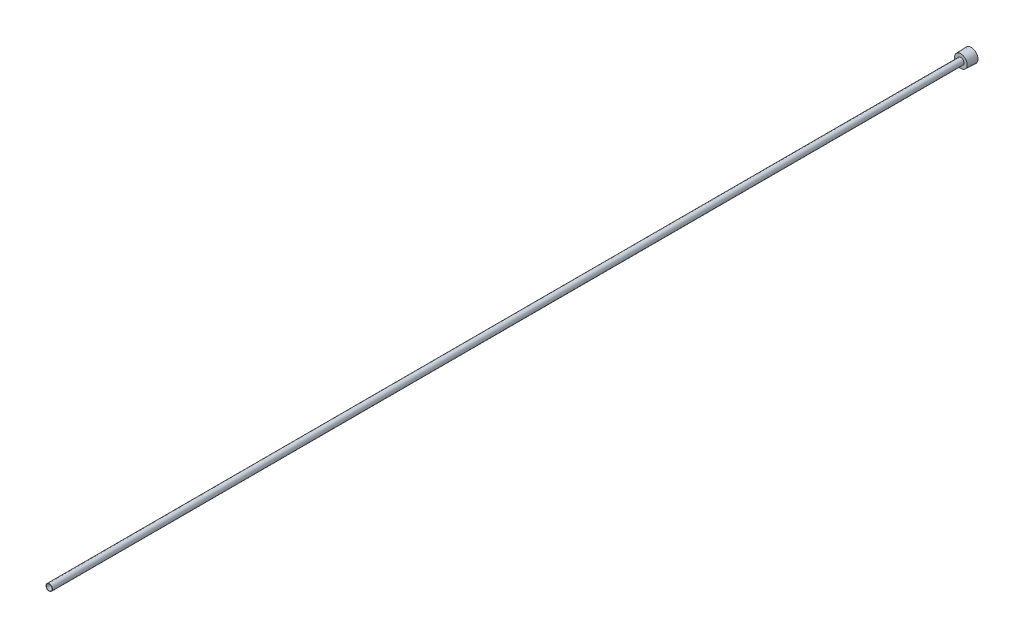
ISO-10303-21;
HEADER;
FILE_DESCRIPTION(('STEP AP214'),'2;1');
FILE_NAME('part.step','',(''),(''),'','','');
FILE_SCHEMA(('AUTOMOTIVE_DESIGN { 1 0 10303 214 1 1 1 1 }'));
ENDSEC;
DATA;
#1=APPLICATION_CONTEXT('core data for automotive mechanical design processes');
#2=APPLICATION_PROTOCOL_DEFINITION('international standard','automotive_design',2000,#1);
#3=PRODUCT_CONTEXT('',#1,'mechanical');
#4=PRODUCT('Part','Part','',(#3));
#5=PRODUCT_RELATED_PRODUCT_CATEGORY('part','',(#4));
#6=PRODUCT_DEFINITION_FORMATION('','',#4);
#7=PRODUCT_DEFINITION_CONTEXT('part definition',#1,'design');
#8=PRODUCT_DEFINITION('design','',#6,#7);
#9=PRODUCT_DEFINITION_SHAPE('','',#8);
#10=(LENGTH_UNIT() NAMED_UNIT(*) SI_UNIT(.MILLI.,.METRE.));
#11=(NAMED_UNIT(*) PLANE_ANGLE_UNIT() SI_UNIT($,.RADIAN.));
#12=(NAMED_UNIT(*) SI_UNIT($,.STERADIAN.) SOLID_ANGLE_UNIT());
#13=UNCERTAINTY_MEASURE_WITH_UNIT(LENGTH_MEASURE(1.E-05),#10,'distance_accuracy_value','');
#14=(GEOMETRIC_REPRESENTATION_CONTEXT(3) GLOBAL_UNCERTAINTY_ASSIGNED_CONTEXT((#13)) GLOBAL_UNIT_ASSIGNED_CONTEXT((#10,
#11,#12)) REPRESENTATION_CONTEXT('',''));
#15=CARTESIAN_POINT('',(0.,0.,0.));
#16=DIRECTION('',(0.,0.,1.));
#17=DIRECTION('',(1.,0.,0.));
#18=AXIS2_PLACEMENT_3D('',#15,#16,#17);
#19=CARTESIAN_POINT('',(0.,0.,0.));
#20=DIRECTION('',(0.,0.,1.));
#21=DIRECTION('',(1.,0.,0.));
#22=AXIS2_PLACEMENT_3D('',#19,#20,#21);
#23=CYLINDRICAL_SURFACE('',#22,2.921);
#24=CARTESIAN_POINT('',(0.,0.,914.4));
#25=DIRECTION('',(0.,0.,1.));
#26=DIRECTION('',(1.,0.,0.));
#27=AXIS2_PLACEMENT_3D('',#24,#25,#26);
#28=CIRCLE('',#27,2.921);
#29=CARTESIAN_POINT('',(2.921,0.,914.4));
#30=VERTEX_POINT('',#29);
#31=EDGE_CURVE('E142',#30,#30,#28,.T.);
#32=ORIENTED_EDGE('',*,*,#31,.T.);
#33=EDGE_LOOP('',(#32));
#34=FACE_BOUND('',#33,.T.);
#35=CARTESIAN_POINT('',(0.,0.,6.35));
#36=DIRECTION('',(0.,0.,-1.));
#37=DIRECTION('',(-1.,0.,0.));
#38=AXIS2_PLACEMENT_3D('',#35,#36,#37);
#39=CIRCLE('',#38,2.921);
#40=CARTESIAN_POINT('',(-2.921,0.,6.35));
#41=VERTEX_POINT('',#40);
#42=EDGE_CURVE('E37',#41,#41,#39,.F.);
#43=ORIENTED_EDGE('',*,*,#42,.F.);
#44=EDGE_LOOP('',(#43));
#45=FACE_BOUND('',#44,.T.);
#46=ADVANCED_FACE('F33',(#34,#45),#23,.F.);
#47=CARTESIAN_POINT('',(0.,0.,0.));
#48=DIRECTION('',(0.,0.,-1.));
#49=DIRECTION('',(-1.,0.,0.));
#50=AXIS2_PLACEMENT_3D('',#47,#48,#49);
#51=CONICAL_SURFACE('',#50,6.7183,0.0364599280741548);
#52=CARTESIAN_POINT('',(0.,0.,10.3124));
#53=DIRECTION('',(0.,0.,1.));
#54=DIRECTION('',(1.,0.,0.));
#55=AXIS2_PLACEMENT_3D('',#52,#53,#54);
#56=CIRCLE('',#55,6.34214394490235);
#57=CARTESIAN_POINT('',(6.34214394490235,0.,10.3124));
#58=VERTEX_POINT('',#57);
#59=EDGE_CURVE('E11',#58,#58,#56,.T.);
#60=ORIENTED_EDGE('',*,*,#59,.F.);
#61=EDGE_LOOP('',(#60));
#62=FACE_BOUND('',#61,.T.);
#63=CARTESIAN_POINT('',(0.,0.,0.));
#64=DIRECTION('',(0.,0.,1.));
#65=DIRECTION('',(1.,0.,0.));
#66=AXIS2_PLACEMENT_3D('',#63,#64,#65);
#67=CIRCLE('',#66,6.7183);
#68=CARTESIAN_POINT('',(6.7183,0.,0.));
#69=VERTEX_POINT('',#68);
#70=EDGE_CURVE('E145',#69,#69,#67,.T.);
#71=ORIENTED_EDGE('',*,*,#70,.T.);
#72=EDGE_LOOP('',(#71));
#73=FACE_BOUND('',#72,.T.);
#74=ADVANCED_FACE('F35',(#62,#73),#51,.T.);
#75=CARTESIAN_POINT('',(0.,6.34214394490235,10.3124));
#76=DIRECTION('',(0.,0.,-1.));
#77=DIRECTION('',(-1.,0.,0.));
#78=AXIS2_PLACEMENT_3D('',#75,#76,#77);
#79=PLANE('',#78);
#80=CARTESIAN_POINT('',(0.,0.,10.3124));
#81=DIRECTION('',(0.,0.,1.));
#82=DIRECTION('',(1.,0.,0.));
#83=AXIS2_PLACEMENT_3D('',#80,#81,#82);
#84=CIRCLE('',#83,3.175);
#85=CARTESIAN_POINT('',(3.175,0.,10.3124));
#86=VERTEX_POINT('',#85);
#87=EDGE_CURVE('E42',#86,#86,#84,.T.);
#88=ORIENTED_EDGE('',*,*,#87,.F.);
#89=EDGE_LOOP('',(#88));
#90=FACE_BOUND('',#89,.T.);
#91=ORIENTED_EDGE('',*,*,#59,.T.);
#92=EDGE_LOOP('',(#91));
#93=FACE_BOUND('',#92,.T.);
#94=ADVANCED_FACE('F156',(#90,#93),#79,.F.);
#95=CARTESIAN_POINT('',(0.,0.,331.124179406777));
#96=DIRECTION('',(0.,0.,1.));
#97=DIRECTION('',(1.,0.,0.));
#98=AXIS2_PLACEMENT_3D('',#95,#96,#97);
#99=CYLINDRICAL_SURFACE('',#98,3.17499999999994);
#100=CARTESIAN_POINT('',(0.,0.,914.4));
#101=DIRECTION('',(0.,0.,1.));
#102=DIRECTION('',(1.,0.,0.));
#103=AXIS2_PLACEMENT_3D('',#100,#101,#102);
#104=CIRCLE('',#103,3.17499999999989);
#105=CARTESIAN_POINT('',(3.17499999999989,0.,914.4));
#106=VERTEX_POINT('',#105);
#107=EDGE_CURVE('E148',#106,#106,#104,.T.);
#108=ORIENTED_EDGE('',*,*,#107,.F.);
#109=EDGE_LOOP('',(#108));
#110=FACE_BOUND('',#109,.T.);
#111=ORIENTED_EDGE('',*,*,#87,.T.);
#112=EDGE_LOOP('',(#111));
#113=FACE_BOUND('',#112,.T.);
#114=ADVANCED_FACE('F154',(#110,#113),#99,.T.);
#115=CARTESIAN_POINT('',(0.,3.17499999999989,914.4));
#116=DIRECTION('',(0.,0.,-1.));
#117=DIRECTION('',(-1.,0.,0.));
#118=AXIS2_PLACEMENT_3D('',#115,#116,#117);
#119=PLANE('',#118);
#120=ORIENTED_EDGE('',*,*,#31,.F.);
#121=EDGE_LOOP('',(#120));
#122=FACE_BOUND('',#121,.T.);
#123=ORIENTED_EDGE('',*,*,#107,.T.);
#124=EDGE_LOOP('',(#123));
#125=FACE_BOUND('',#124,.T.);
#126=ADVANCED_FACE('F167',(#122,#125),#119,.F.);
#127=CARTESIAN_POINT('',(0.,0.,0.));
#128=DIRECTION('',(0.,0.,1.));
#129=DIRECTION('',(1.,0.,0.));
#130=AXIS2_PLACEMENT_3D('',#127,#128,#129);
#131=PLANE('',#130);
#132=DIRECTION('',(-0.866025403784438,-0.5,0.));
#133=VECTOR('',#132,1.);
#134=CARTESIAN_POINT('',(3.175,-1.83308710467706,0.));
#135=LINE('',#134,#133);
#136=CARTESIAN_POINT('',(3.175,-1.83308710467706,0.));
#137=VERTEX_POINT('',#136);
#138=CARTESIAN_POINT('',(0.,-3.66617420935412,0.));
#139=VERTEX_POINT('',#138);
#140=EDGE_CURVE('E124',#137,#139,#135,.T.);
#141=ORIENTED_EDGE('',*,*,#140,.F.);
#142=DIRECTION('',(0.,-1.,0.));
#143=VECTOR('',#142,1.);
#144=CARTESIAN_POINT('',(3.175,1.83308710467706,0.));
#145=LINE('',#144,#143);
#146=CARTESIAN_POINT('',(3.175,1.83308710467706,0.));
#147=VERTEX_POINT('',#146);
#148=EDGE_CURVE('E49',#147,#137,#145,.T.);
#149=ORIENTED_EDGE('',*,*,#148,.F.);
#150=DIRECTION('',(0.866025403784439,-0.5,0.));
#151=VECTOR('',#150,1.);
#152=CARTESIAN_POINT('',(0.,3.66617420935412,0.));
#153=LINE('',#152,#151);
#154=CARTESIAN_POINT('',(0.,3.66617420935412,0.));
#155=VERTEX_POINT('',#154);
#156=EDGE_CURVE('E133',#155,#147,#153,.T.);
#157=ORIENTED_EDGE('',*,*,#156,.F.);
#158=DIRECTION('',(0.866025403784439,0.5,0.));
#159=VECTOR('',#158,1.);
#160=CARTESIAN_POINT('',(-3.175,1.83308710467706,0.));
#161=LINE('',#160,#159);
#162=CARTESIAN_POINT('',(-3.175,1.83308710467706,0.));
#163=VERTEX_POINT('',#162);
#164=EDGE_CURVE('E131',#163,#155,#161,.T.);
#165=ORIENTED_EDGE('',*,*,#164,.F.);
#166=DIRECTION('',(0.,1.,0.));
#167=VECTOR('',#166,1.);
#168=CARTESIAN_POINT('',(-3.175,-1.83308710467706,0.));
#169=LINE('',#168,#167);
#170=CARTESIAN_POINT('',(-3.175,-1.83308710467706,0.));
#171=VERTEX_POINT('',#170);
#172=EDGE_CURVE('E97',#171,#163,#169,.T.);
#173=ORIENTED_EDGE('',*,*,#172,.F.);
#174=DIRECTION('',(-0.866025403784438,0.5,0.));
#175=VECTOR('',#174,1.);
#176=CARTESIAN_POINT('',(0.,-3.66617420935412,0.));
#177=LINE('',#176,#175);
#178=EDGE_CURVE('E127',#139,#171,#177,.T.);
#179=ORIENTED_EDGE('',*,*,#178,.F.);
#180=EDGE_LOOP('',(#141,#149,#157,#165,#173,#179));
#181=FACE_BOUND('',#180,.T.);
#182=ORIENTED_EDGE('',*,*,#70,.F.);
#183=EDGE_LOOP('',(#182));
#184=FACE_BOUND('',#183,.T.);
#185=ADVANCED_FACE('F165',(#181,#184),#131,.F.);
#186=CARTESIAN_POINT('',(3.175,-1.83308710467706,6.35));
#187=DIRECTION('',(0.,0.,-1.));
#188=DIRECTION('',(-1.,0.,0.));
#189=AXIS2_PLACEMENT_3D('',#186,#187,#188);
#190=PLANE('',#189);
#191=DIRECTION('',(0.,-1.,0.));
#192=VECTOR('',#191,1.);
#193=CARTESIAN_POINT('',(3.175,1.83308710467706,6.35));
#194=LINE('',#193,#192);
#195=CARTESIAN_POINT('',(3.175,1.83308710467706,6.35));
#196=VERTEX_POINT('',#195);
#197=CARTESIAN_POINT('',(3.175,-1.83308710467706,6.35));
#198=VERTEX_POINT('',#197);
#199=EDGE_CURVE('E135',#196,#198,#194,.T.);
#200=ORIENTED_EDGE('',*,*,#199,.T.);
#201=DIRECTION('',(-0.866025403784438,-0.5,0.));
#202=VECTOR('',#201,1.);
#203=CARTESIAN_POINT('',(3.175,-1.83308710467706,6.35));
#204=LINE('',#203,#202);
#205=CARTESIAN_POINT('',(0.,-3.66617420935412,6.35));
#206=VERTEX_POINT('',#205);
#207=EDGE_CURVE('E118',#198,#206,#204,.T.);
#208=ORIENTED_EDGE('',*,*,#207,.T.);
#209=DIRECTION('',(-0.866025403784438,0.5,0.));
#210=VECTOR('',#209,1.);
#211=CARTESIAN_POINT('',(0.,-3.66617420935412,6.35));
#212=LINE('',#211,#210);
#213=CARTESIAN_POINT('',(-3.175,-1.83308710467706,6.35));
#214=VERTEX_POINT('',#213);
#215=EDGE_CURVE('E116',#206,#214,#212,.T.);
#216=ORIENTED_EDGE('',*,*,#215,.T.);
#217=DIRECTION('',(0.,1.,0.));
#218=VECTOR('',#217,1.);
#219=CARTESIAN_POINT('',(-3.175,-1.83308710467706,6.35));
#220=LINE('',#219,#218);
#221=CARTESIAN_POINT('',(-3.175,1.83308710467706,6.35));
#222=VERTEX_POINT('',#221);
#223=EDGE_CURVE('E94',#214,#222,#220,.T.);
#224=ORIENTED_EDGE('',*,*,#223,.T.);
#225=DIRECTION('',(0.866025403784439,0.5,0.));
#226=VECTOR('',#225,1.);
#227=CARTESIAN_POINT('',(-3.175,1.83308710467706,6.35));
#228=LINE('',#227,#226);
#229=CARTESIAN_POINT('',(0.,3.66617420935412,6.35));
#230=VERTEX_POINT('',#229);
#231=EDGE_CURVE('E105',#222,#230,#228,.T.);
#232=ORIENTED_EDGE('',*,*,#231,.T.);
#233=DIRECTION('',(0.866025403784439,-0.5,0.));
#234=VECTOR('',#233,1.);
#235=CARTESIAN_POINT('',(0.,3.66617420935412,6.35));
#236=LINE('',#235,#234);
#237=EDGE_CURVE('E109',#230,#196,#236,.T.);
#238=ORIENTED_EDGE('',*,*,#237,.T.);
#239=EDGE_LOOP('',(#200,#208,#216,#224,#232,#238));
#240=FACE_BOUND('',#239,.T.);
#241=ORIENTED_EDGE('',*,*,#42,.T.);
#242=EDGE_LOOP('',(#241));
#243=FACE_BOUND('',#242,.T.);
#244=ADVANCED_FACE('F112',(#240,#243),#190,.T.);
#245=CARTESIAN_POINT('',(3.175,1.83308710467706,6.35));
#246=DIRECTION('',(1.,0.,0.));
#247=DIRECTION('',(0.,1.,0.));
#248=AXIS2_PLACEMENT_3D('',#245,#246,#247);
#249=PLANE('',#248);
#250=ORIENTED_EDGE('',*,*,#148,.T.);
#251=DIRECTION('',(0.,0.,-1.));
#252=VECTOR('',#251,1.);
#253=CARTESIAN_POINT('',(3.175,-1.83308710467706,6.35));
#254=LINE('',#253,#252);
#255=EDGE_CURVE('E79',#198,#137,#254,.T.);
#256=ORIENTED_EDGE('',*,*,#255,.F.);
#257=ORIENTED_EDGE('',*,*,#199,.F.);
#258=DIRECTION('',(0.,0.,-1.));
#259=VECTOR('',#258,1.);
#260=CARTESIAN_POINT('',(3.175,1.83308710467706,6.35));
#261=LINE('',#260,#259);
#262=EDGE_CURVE('E57',#196,#147,#261,.T.);
#263=ORIENTED_EDGE('',*,*,#262,.T.);
#264=EDGE_LOOP('',(#250,#256,#257,#263));
#265=FACE_BOUND('',#264,.T.);
#266=ADVANCED_FACE('F174',(#265),#249,.F.);
#267=CARTESIAN_POINT('',(0.,3.66617420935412,6.35));
#268=DIRECTION('',(0.5,0.866025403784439,0.));
#269=DIRECTION('',(-0.866025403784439,0.5,0.));
#270=AXIS2_PLACEMENT_3D('',#267,#268,#269);
#271=PLANE('',#270);
#272=ORIENTED_EDGE('',*,*,#156,.T.);
#273=ORIENTED_EDGE('',*,*,#262,.F.);
#274=ORIENTED_EDGE('',*,*,#237,.F.);
#275=DIRECTION('',(0.,0.,-1.));
#276=VECTOR('',#275,1.);
#277=CARTESIAN_POINT('',(0.,3.66617420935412,6.35));
#278=LINE('',#277,#276);
#279=EDGE_CURVE('E101',#230,#155,#278,.T.);
#280=ORIENTED_EDGE('',*,*,#279,.T.);
#281=EDGE_LOOP('',(#272,#273,#274,#280));
#282=FACE_BOUND('',#281,.T.);
#283=ADVANCED_FACE('F188',(#282),#271,.F.);
#284=CARTESIAN_POINT('',(-3.175,1.83308710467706,6.35));
#285=DIRECTION('',(-0.5,0.866025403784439,0.));
#286=DIRECTION('',(-0.866025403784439,-0.5,0.));
#287=AXIS2_PLACEMENT_3D('',#284,#285,#286);
#288=PLANE('',#287);
#289=ORIENTED_EDGE('',*,*,#164,.T.);
#290=ORIENTED_EDGE('',*,*,#279,.F.);
#291=ORIENTED_EDGE('',*,*,#231,.F.);
#292=DIRECTION('',(0.,0.,-1.));
#293=VECTOR('',#292,1.);
#294=CARTESIAN_POINT('',(-3.175,1.83308710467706,6.35));
#295=LINE('',#294,#293);
#296=EDGE_CURVE('E90',#222,#163,#295,.T.);
#297=ORIENTED_EDGE('',*,*,#296,.T.);
#298=EDGE_LOOP('',(#289,#290,#291,#297));
#299=FACE_BOUND('',#298,.T.);
#300=ADVANCED_FACE('F106',(#299),#288,.F.);
#301=CARTESIAN_POINT('',(-3.175,-1.83308710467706,6.35));
#302=DIRECTION('',(-1.,0.,0.));
#303=DIRECTION('',(0.,-1.,0.));
#304=AXIS2_PLACEMENT_3D('',#301,#302,#303);
#305=PLANE('',#304);
#306=ORIENTED_EDGE('',*,*,#172,.T.);
#307=ORIENTED_EDGE('',*,*,#296,.F.);
#308=ORIENTED_EDGE('',*,*,#223,.F.);
#309=DIRECTION('',(0.,0.,-1.));
#310=VECTOR('',#309,1.);
#311=CARTESIAN_POINT('',(-3.175,-1.83308710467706,6.35));
#312=LINE('',#311,#310);
#313=EDGE_CURVE('E102',#214,#171,#312,.T.);
#314=ORIENTED_EDGE('',*,*,#313,.T.);
#315=EDGE_LOOP('',(#306,#307,#308,#314));
#316=FACE_BOUND('',#315,.T.);
#317=ADVANCED_FACE('F92',(#316),#305,.F.);
#318=CARTESIAN_POINT('',(0.,-3.66617420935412,6.35));
#319=DIRECTION('',(-0.5,-0.866025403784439,0.));
#320=DIRECTION('',(0.866025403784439,-0.5,0.));
#321=AXIS2_PLACEMENT_3D('',#318,#319,#320);
#322=PLANE('',#321);
#323=ORIENTED_EDGE('',*,*,#178,.T.);
#324=ORIENTED_EDGE('',*,*,#313,.F.);
#325=ORIENTED_EDGE('',*,*,#215,.F.);
#326=DIRECTION('',(0.,0.,-1.));
#327=VECTOR('',#326,1.);
#328=CARTESIAN_POINT('',(0.,-3.66617420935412,6.35));
#329=LINE('',#328,#327);
#330=EDGE_CURVE('E139',#206,#139,#329,.T.);
#331=ORIENTED_EDGE('',*,*,#330,.T.);
#332=EDGE_LOOP('',(#323,#324,#325,#331));
#333=FACE_BOUND('',#332,.T.);
#334=ADVANCED_FACE('F192',(#333),#322,.F.);
#335=CARTESIAN_POINT('',(3.175,-1.83308710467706,6.35));
#336=DIRECTION('',(0.5,-0.866025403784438,0.));
#337=DIRECTION('',(0.866025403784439,0.5,0.));
#338=AXIS2_PLACEMENT_3D('',#335,#336,#337);
#339=PLANE('',#338);
#340=ORIENTED_EDGE('',*,*,#140,.T.);
#341=ORIENTED_EDGE('',*,*,#330,.F.);
#342=ORIENTED_EDGE('',*,*,#207,.F.);
#343=ORIENTED_EDGE('',*,*,#255,.T.);
#344=EDGE_LOOP('',(#340,#341,#342,#343));
#345=FACE_BOUND('',#344,.T.);
#346=ADVANCED_FACE('F189',(#345),#339,.F.);
#347=CLOSED_SHELL('',(#46,#74,#94,#114,#126,#185,#244,#266,#283,#300,#317,#334,#346));
#348=MANIFOLD_SOLID_BREP('B2',#347);
#349=ADVANCED_BREP_SHAPE_REPRESENTATION('',(#18,#348),#14);
#350=SHAPE_DEFINITION_REPRESENTATION(#9,#349);
ENDSEC;
END-ISO-10303-21;
